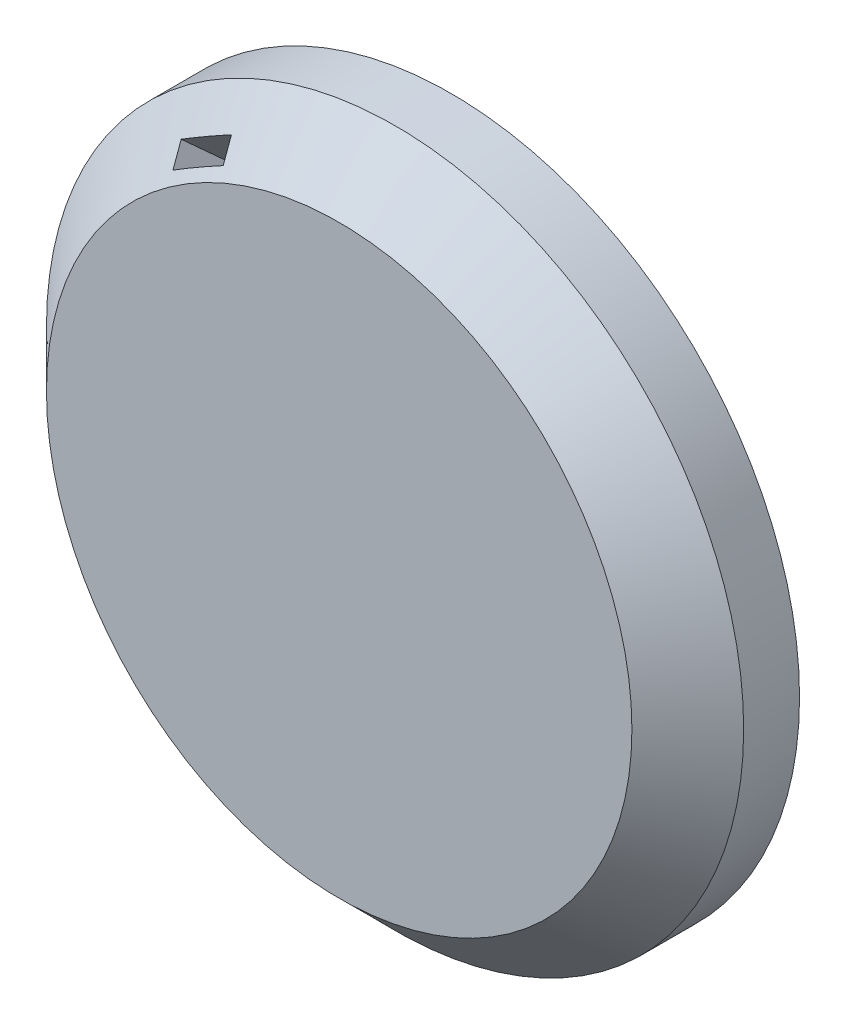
from build123d import *

# Parameters (mm, degrees)
SKIZZE1_R                       = 62.389337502
LINEAR_AUSTRAGEN1_DEPTH         = 20
FASE1_SIZE                      = 10
SCHNITT_LINEAR_AUSTRAGEN2_DEPTH = 12


with BuildPart() as part:
    # Skizze1 → Linear austragen1 (new body)
    with BuildSketch(Plane.XY):
        Circle(SKIZZE1_R)
    extrude(amount=-LINEAR_AUSTRAGEN1_DEPTH)

    # Fase1
    fase1_edges = [part.edges().sort_by_distance(p)[0] for p in [
        (-62.389337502, 0, 0),
    ]]
    chamfer(fase1_edges, length=FASE1_SIZE)

    # Skizze4 → Schnitt-Linear austragen2 (cut)
    with BuildSketch(Plane(origin=(-13.097334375, 22.685248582, 26.194668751), x_dir=(0.9354143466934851, 0.23145502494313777, 0.2672612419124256), z_dir=(-0.3535533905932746, 0.6123724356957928, 0.7071067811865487))):
        Polygon((-19.615762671, 34.316058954), (-10.004979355, 38.239644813), (-11.585920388, 42.112143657), (-21.196703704, 38.188557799), align=None)
    extrude(amount=-SCHNITT_LINEAR_AUSTRAGEN2_DEPTH, mode=Mode.SUBTRACT)


solid = part.part
